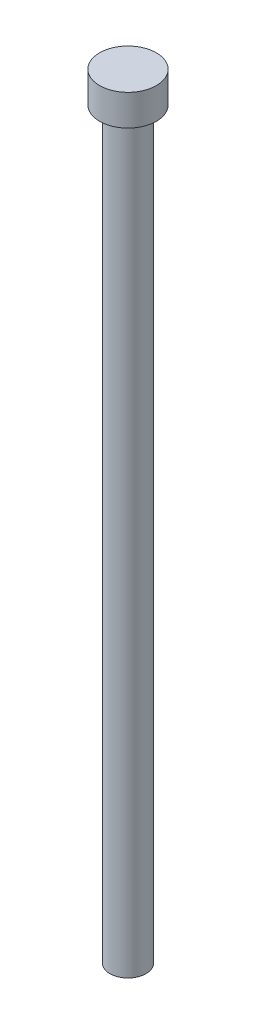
ISO-10303-21;
HEADER;
FILE_DESCRIPTION(('STEP AP214'),'2;1');
FILE_NAME('part.step','',(''),(''),'','','');
FILE_SCHEMA(('AUTOMOTIVE_DESIGN { 1 0 10303 214 1 1 1 1 }'));
ENDSEC;
DATA;
#1=APPLICATION_CONTEXT('core data for automotive mechanical design processes');
#2=APPLICATION_PROTOCOL_DEFINITION('international standard','automotive_design',2000,#1);
#3=PRODUCT_CONTEXT('',#1,'mechanical');
#4=PRODUCT('Part','Part','',(#3));
#5=PRODUCT_RELATED_PRODUCT_CATEGORY('part','',(#4));
#6=PRODUCT_DEFINITION_FORMATION('','',#4);
#7=PRODUCT_DEFINITION_CONTEXT('part definition',#1,'design');
#8=PRODUCT_DEFINITION('design','',#6,#7);
#9=PRODUCT_DEFINITION_SHAPE('','',#8);
#10=(LENGTH_UNIT() NAMED_UNIT(*) SI_UNIT(.MILLI.,.METRE.));
#11=(NAMED_UNIT(*) PLANE_ANGLE_UNIT() SI_UNIT($,.RADIAN.));
#12=(NAMED_UNIT(*) SI_UNIT($,.STERADIAN.) SOLID_ANGLE_UNIT());
#13=UNCERTAINTY_MEASURE_WITH_UNIT(LENGTH_MEASURE(1.E-05),#10,'distance_accuracy_value','');
#14=(GEOMETRIC_REPRESENTATION_CONTEXT(3) GLOBAL_UNCERTAINTY_ASSIGNED_CONTEXT((#13)) GLOBAL_UNIT_ASSIGNED_CONTEXT((#10,
#11,#12)) REPRESENTATION_CONTEXT('',''));
#15=CARTESIAN_POINT('',(0.,0.,0.));
#16=DIRECTION('',(0.,0.,1.));
#17=DIRECTION('',(1.,0.,0.));
#18=AXIS2_PLACEMENT_3D('',#15,#16,#17);
#19=CARTESIAN_POINT('',(0.,-6.,0.));
#20=DIRECTION('',(0.,1.,0.));
#21=DIRECTION('',(0.,0.,1.));
#22=AXIS2_PLACEMENT_3D('',#19,#20,#21);
#23=PLANE('',#22);
#24=CARTESIAN_POINT('',(0.,-6.,0.));
#25=DIRECTION('',(0.,1.,0.));
#26=DIRECTION('',(0.,0.,1.));
#27=AXIS2_PLACEMENT_3D('',#24,#25,#26);
#28=CIRCLE('',#27,3.8);
#29=CARTESIAN_POINT('',(0.,-6.,3.8));
#30=VERTEX_POINT('',#29);
#31=EDGE_CURVE('E10',#30,#30,#28,.T.);
#32=ORIENTED_EDGE('',*,*,#31,.T.);
#33=EDGE_LOOP('',(#32));
#34=FACE_BOUND('',#33,.T.);
#35=CARTESIAN_POINT('',(0.,-6.,0.));
#36=DIRECTION('',(0.,1.,0.));
#37=DIRECTION('',(0.,0.,1.));
#38=AXIS2_PLACEMENT_3D('',#35,#36,#37);
#39=CIRCLE('',#38,5.5);
#40=CARTESIAN_POINT('',(0.,-6.,5.5));
#41=VERTEX_POINT('',#40);
#42=EDGE_CURVE('E39',#41,#41,#39,.T.);
#43=ORIENTED_EDGE('',*,*,#42,.F.);
#44=EDGE_LOOP('',(#43));
#45=FACE_BOUND('',#44,.T.);
#46=ADVANCED_FACE('F28',(#34,#45),#23,.F.);
#47=CARTESIAN_POINT('',(0.,-6.,0.));
#48=DIRECTION('',(0.,1.,0.));
#49=DIRECTION('',(0.,0.,1.));
#50=AXIS2_PLACEMENT_3D('',#47,#48,#49);
#51=CYLINDRICAL_SURFACE('',#50,5.5);
#52=ORIENTED_EDGE('',*,*,#42,.T.);
#53=EDGE_LOOP('',(#52));
#54=FACE_BOUND('',#53,.T.);
#55=CARTESIAN_POINT('',(0.,0.,0.));
#56=DIRECTION('',(0.,1.,0.));
#57=DIRECTION('',(0.,0.,1.));
#58=AXIS2_PLACEMENT_3D('',#55,#56,#57);
#59=CIRCLE('',#58,5.5);
#60=CARTESIAN_POINT('',(0.,0.,5.5));
#61=VERTEX_POINT('',#60);
#62=EDGE_CURVE('E43',#61,#61,#59,.T.);
#63=ORIENTED_EDGE('',*,*,#62,.F.);
#64=EDGE_LOOP('',(#63));
#65=FACE_BOUND('',#64,.T.);
#66=ADVANCED_FACE('F63',(#54,#65),#51,.T.);
#67=CARTESIAN_POINT('',(0.,0.,0.));
#68=DIRECTION('',(0.,1.,0.));
#69=DIRECTION('',(0.,0.,1.));
#70=AXIS2_PLACEMENT_3D('',#67,#68,#69);
#71=PLANE('',#70);
#72=ORIENTED_EDGE('',*,*,#62,.T.);
#73=EDGE_LOOP('',(#72));
#74=FACE_BOUND('',#73,.T.);
#75=ADVANCED_FACE('F56',(#74),#71,.T.);
#76=CARTESIAN_POINT('',(0.,-150.,0.));
#77=DIRECTION('',(0.,1.,0.));
#78=DIRECTION('',(0.,0.,1.));
#79=AXIS2_PLACEMENT_3D('',#76,#77,#78);
#80=CYLINDRICAL_SURFACE('',#79,3.5);
#81=CARTESIAN_POINT('',(0.,-6.3,0.));
#82=DIRECTION('',(0.,1.,0.));
#83=DIRECTION('',(0.,0.,1.));
#84=AXIS2_PLACEMENT_3D('',#81,#82,#83);
#85=CIRCLE('',#84,3.5);
#86=CARTESIAN_POINT('',(0.,-6.3,3.5));
#87=VERTEX_POINT('',#86);
#88=EDGE_CURVE('E35',#87,#87,#85,.F.);
#89=ORIENTED_EDGE('',*,*,#88,.T.);
#90=EDGE_LOOP('',(#89));
#91=FACE_BOUND('',#90,.T.);
#92=CARTESIAN_POINT('',(0.,-150.,0.));
#93=DIRECTION('',(0.,-1.,0.));
#94=DIRECTION('',(0.,0.,-1.));
#95=AXIS2_PLACEMENT_3D('',#92,#93,#94);
#96=CIRCLE('',#95,3.5);
#97=CARTESIAN_POINT('',(0.,-150.,-3.5));
#98=VERTEX_POINT('',#97);
#99=EDGE_CURVE('E47',#98,#98,#96,.T.);
#100=ORIENTED_EDGE('',*,*,#99,.F.);
#101=EDGE_LOOP('',(#100));
#102=FACE_BOUND('',#101,.T.);
#103=ADVANCED_FACE('F54',(#91,#102),#80,.T.);
#104=CARTESIAN_POINT('',(0.,-150.,0.));
#105=DIRECTION('',(0.,-1.,0.));
#106=DIRECTION('',(0.,0.,-1.));
#107=AXIS2_PLACEMENT_3D('',#104,#105,#106);
#108=PLANE('',#107);
#109=ORIENTED_EDGE('',*,*,#99,.T.);
#110=EDGE_LOOP('',(#109));
#111=FACE_BOUND('',#110,.T.);
#112=ADVANCED_FACE('F52',(#111),#108,.T.);
#113=CARTESIAN_POINT('',(0.,-6.3,0.));
#114=DIRECTION('',(0.,1.,0.));
#115=DIRECTION('',(0.,0.,1.));
#116=AXIS2_PLACEMENT_3D('',#113,#114,#115);
#117=TOROIDAL_SURFACE('',#116,3.8,0.3);
#118=ORIENTED_EDGE('',*,*,#31,.F.);
#119=EDGE_LOOP('',(#118));
#120=FACE_BOUND('',#119,.T.);
#121=ORIENTED_EDGE('',*,*,#88,.F.);
#122=EDGE_LOOP('',(#121));
#123=FACE_BOUND('',#122,.T.);
#124=ADVANCED_FACE('F30',(#120,#123),#117,.F.);
#125=CLOSED_SHELL('',(#46,#66,#75,#103,#112,#124));
#126=MANIFOLD_SOLID_BREP('B2',#125);
#127=ADVANCED_BREP_SHAPE_REPRESENTATION('',(#18,#126),#14);
#128=SHAPE_DEFINITION_REPRESENTATION(#9,#127);
ENDSEC;
END-ISO-10303-21;
